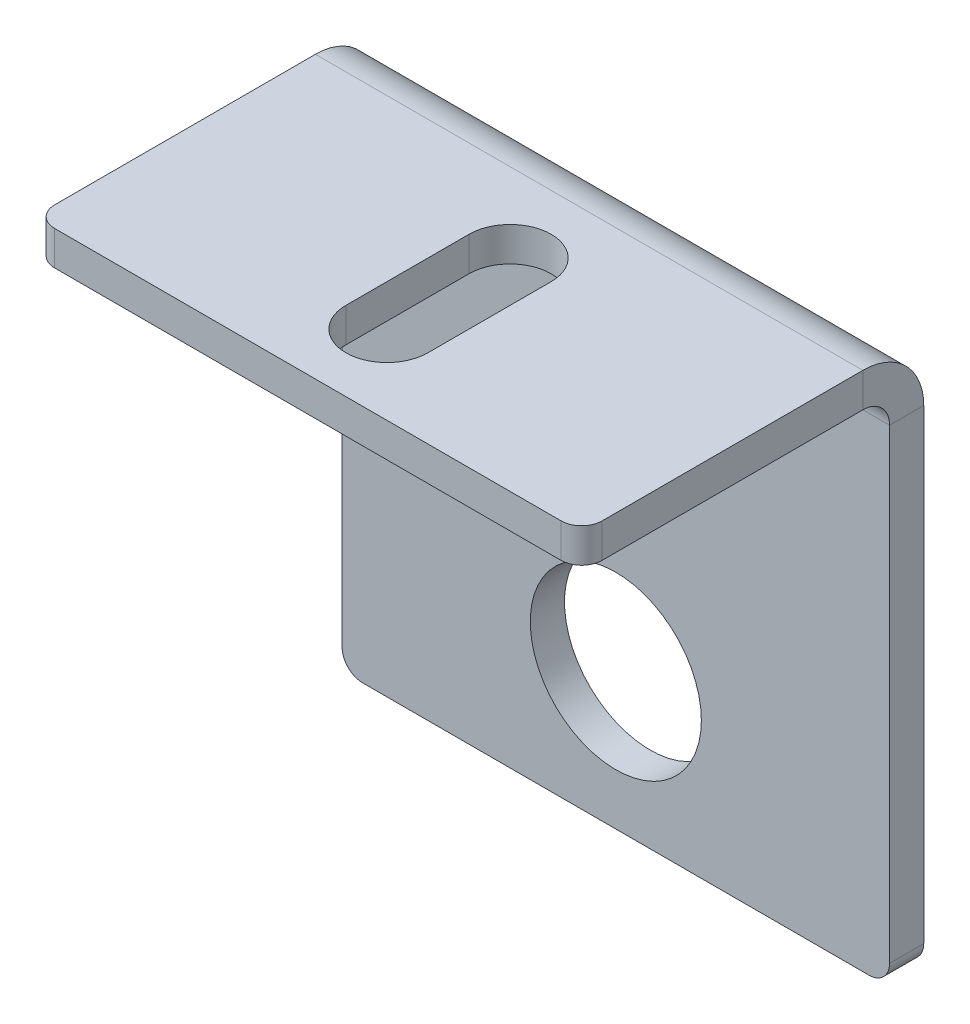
ISO-10303-21;
HEADER;
FILE_DESCRIPTION(('STEP AP214'),'2;1');
FILE_NAME('part.step','',(''),(''),'','','');
FILE_SCHEMA(('AUTOMOTIVE_DESIGN { 1 0 10303 214 1 1 1 1 }'));
ENDSEC;
DATA;
#1=APPLICATION_CONTEXT('core data for automotive mechanical design processes');
#2=APPLICATION_PROTOCOL_DEFINITION('international standard','automotive_design',2000,#1);
#3=PRODUCT_CONTEXT('',#1,'mechanical');
#4=PRODUCT('Part','Part','',(#3));
#5=PRODUCT_RELATED_PRODUCT_CATEGORY('part','',(#4));
#6=PRODUCT_DEFINITION_FORMATION('','',#4);
#7=PRODUCT_DEFINITION_CONTEXT('part definition',#1,'design');
#8=PRODUCT_DEFINITION('design','',#6,#7);
#9=PRODUCT_DEFINITION_SHAPE('','',#8);
#10=(LENGTH_UNIT() NAMED_UNIT(*) SI_UNIT(.MILLI.,.METRE.));
#11=(NAMED_UNIT(*) PLANE_ANGLE_UNIT() SI_UNIT($,.RADIAN.));
#12=(NAMED_UNIT(*) SI_UNIT($,.STERADIAN.) SOLID_ANGLE_UNIT());
#13=UNCERTAINTY_MEASURE_WITH_UNIT(LENGTH_MEASURE(1.E-05),#10,'distance_accuracy_value','');
#14=(GEOMETRIC_REPRESENTATION_CONTEXT(3) GLOBAL_UNCERTAINTY_ASSIGNED_CONTEXT((#13)) GLOBAL_UNIT_ASSIGNED_CONTEXT((#10,
#11,#12)) REPRESENTATION_CONTEXT('',''));
#15=CARTESIAN_POINT('',(0.,0.,0.));
#16=DIRECTION('',(0.,0.,1.));
#17=DIRECTION('',(1.,0.,0.));
#18=AXIS2_PLACEMENT_3D('',#15,#16,#17);
#19=CARTESIAN_POINT('',(-40.,-40.,-5.));
#20=DIRECTION('',(-1.,0.,0.));
#21=DIRECTION('',(0.,0.,1.));
#22=AXIS2_PLACEMENT_3D('',#19,#20,#21);
#23=PLANE('',#22);
#24=DIRECTION('',(0.,-1.,0.));
#25=VECTOR('',#24,1.);
#26=CARTESIAN_POINT('',(-40.,-40.,-5.));
#27=LINE('',#26,#25);
#28=CARTESIAN_POINT('',(-40.,31.1,-5.));
#29=VERTEX_POINT('',#28);
#30=CARTESIAN_POINT('',(-40.,-37.,-5.));
#31=VERTEX_POINT('',#30);
#32=EDGE_CURVE('E262',#29,#31,#27,.T.);
#33=ORIENTED_EDGE('',*,*,#32,.T.);
#34=DIRECTION('',(0.,0.,1.));
#35=VECTOR('',#34,1.);
#36=CARTESIAN_POINT('',(-40.,-37.,-5.));
#37=LINE('',#36,#35);
#38=CARTESIAN_POINT('',(-40.,-37.,0.));
#39=VERTEX_POINT('',#38);
#40=EDGE_CURVE('E271',#31,#39,#37,.T.);
#41=ORIENTED_EDGE('',*,*,#40,.T.);
#42=DIRECTION('',(0.,-1.,0.));
#43=VECTOR('',#42,1.);
#44=CARTESIAN_POINT('',(-40.,-40.,0.));
#45=LINE('',#44,#43);
#46=CARTESIAN_POINT('',(-40.,31.1,0.));
#47=VERTEX_POINT('',#46);
#48=EDGE_CURVE('E259',#47,#39,#45,.T.);
#49=ORIENTED_EDGE('',*,*,#48,.F.);
#50=DIRECTION('',(0.,0.,-1.));
#51=VECTOR('',#50,1.);
#52=CARTESIAN_POINT('',(-40.,31.1,0.));
#53=LINE('',#52,#51);
#54=EDGE_CURVE('E245',#47,#29,#53,.T.);
#55=ORIENTED_EDGE('',*,*,#54,.T.);
#56=EDGE_LOOP('',(#33,#41,#49,#55));
#57=FACE_BOUND('',#56,.T.);
#58=ADVANCED_FACE('F55',(#57),#23,.T.);
#59=CARTESIAN_POINT('',(0.,0.,-5.));
#60=DIRECTION('',(0.,0.,1.));
#61=DIRECTION('',(1.,0.,0.));
#62=AXIS2_PLACEMENT_3D('',#59,#60,#61);
#63=PLANE('',#62);
#64=CARTESIAN_POINT('',(0.,-19.9999999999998,-5.));
#65=DIRECTION('',(0.,0.,1.));
#66=DIRECTION('',(1.,0.,0.));
#67=AXIS2_PLACEMENT_3D('',#64,#65,#66);
#68=CIRCLE('',#67,12.5);
#69=CARTESIAN_POINT('',(12.5,-19.9999999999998,-5.));
#70=VERTEX_POINT('',#69);
#71=EDGE_CURVE('E207',#70,#70,#68,.F.);
#72=ORIENTED_EDGE('',*,*,#71,.F.);
#73=EDGE_LOOP('',(#72));
#74=FACE_BOUND('',#73,.T.);
#75=DIRECTION('',(1.,0.,0.));
#76=VECTOR('',#75,1.);
#77=CARTESIAN_POINT('',(40.,-40.,-5.));
#78=LINE('',#77,#76);
#79=CARTESIAN_POINT('',(-37.,-40.,-5.));
#80=VERTEX_POINT('',#79);
#81=CARTESIAN_POINT('',(37.,-40.,-5.));
#82=VERTEX_POINT('',#81);
#83=EDGE_CURVE('E265',#80,#82,#78,.T.);
#84=ORIENTED_EDGE('',*,*,#83,.F.);
#85=CARTESIAN_POINT('',(-37.,-37.,-5.));
#86=DIRECTION('',(0.,0.,1.));
#87=DIRECTION('',(1.,0.,0.));
#88=AXIS2_PLACEMENT_3D('',#85,#86,#87);
#89=CIRCLE('',#88,3.);
#90=EDGE_CURVE('E291',#80,#31,#89,.F.);
#91=ORIENTED_EDGE('',*,*,#90,.T.);
#92=ORIENTED_EDGE('',*,*,#32,.F.);
#93=DIRECTION('',(-1.,0.,0.));
#94=VECTOR('',#93,1.);
#95=CARTESIAN_POINT('',(-40.,31.1,-5.));
#96=LINE('',#95,#94);
#97=CARTESIAN_POINT('',(40.,31.1000000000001,-5.));
#98=VERTEX_POINT('',#97);
#99=EDGE_CURVE('E238',#29,#98,#96,.F.);
#100=ORIENTED_EDGE('',*,*,#99,.T.);
#101=DIRECTION('',(0.,1.,0.));
#102=VECTOR('',#101,1.);
#103=CARTESIAN_POINT('',(40.,-40.,-5.));
#104=LINE('',#103,#102);
#105=CARTESIAN_POINT('',(40.,-37.,-5.));
#106=VERTEX_POINT('',#105);
#107=EDGE_CURVE('E269',#106,#98,#104,.T.);
#108=ORIENTED_EDGE('',*,*,#107,.F.);
#109=CARTESIAN_POINT('',(37.,-37.,-5.));
#110=DIRECTION('',(0.,0.,1.));
#111=DIRECTION('',(1.,0.,0.));
#112=AXIS2_PLACEMENT_3D('',#109,#110,#111);
#113=CIRCLE('',#112,3.);
#114=EDGE_CURVE('E289',#106,#82,#113,.F.);
#115=ORIENTED_EDGE('',*,*,#114,.T.);
#116=EDGE_LOOP('',(#84,#91,#92,#100,#108,#115));
#117=FACE_BOUND('',#116,.T.);
#118=ADVANCED_FACE('F370',(#74,#117),#63,.F.);
#119=CARTESIAN_POINT('',(0.,0.,0.));
#120=DIRECTION('',(0.,0.,1.));
#121=DIRECTION('',(1.,0.,0.));
#122=AXIS2_PLACEMENT_3D('',#119,#120,#121);
#123=PLANE('',#122);
#124=CARTESIAN_POINT('',(0.,-19.9999999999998,0.));
#125=DIRECTION('',(0.,0.,1.));
#126=DIRECTION('',(1.,0.,0.));
#127=AXIS2_PLACEMENT_3D('',#124,#125,#126);
#128=CIRCLE('',#127,12.5);
#129=CARTESIAN_POINT('',(12.5,-19.9999999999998,0.));
#130=VERTEX_POINT('',#129);
#131=EDGE_CURVE('E201',#130,#130,#128,.T.);
#132=ORIENTED_EDGE('',*,*,#131,.F.);
#133=EDGE_LOOP('',(#132));
#134=FACE_BOUND('',#133,.T.);
#135=ORIENTED_EDGE('',*,*,#48,.T.);
#136=CARTESIAN_POINT('',(-37.,-37.,0.));
#137=DIRECTION('',(0.,0.,1.));
#138=DIRECTION('',(1.,0.,0.));
#139=AXIS2_PLACEMENT_3D('',#136,#137,#138);
#140=CIRCLE('',#139,3.);
#141=CARTESIAN_POINT('',(-37.,-40.,0.));
#142=VERTEX_POINT('',#141);
#143=EDGE_CURVE('E282',#39,#142,#140,.T.);
#144=ORIENTED_EDGE('',*,*,#143,.T.);
#145=DIRECTION('',(1.,0.,0.));
#146=VECTOR('',#145,1.);
#147=CARTESIAN_POINT('',(40.,-40.,0.));
#148=LINE('',#147,#146);
#149=CARTESIAN_POINT('',(37.,-40.,0.));
#150=VERTEX_POINT('',#149);
#151=EDGE_CURVE('E274',#142,#150,#148,.T.);
#152=ORIENTED_EDGE('',*,*,#151,.T.);
#153=CARTESIAN_POINT('',(37.,-37.,0.));
#154=DIRECTION('',(0.,0.,1.));
#155=DIRECTION('',(1.,0.,0.));
#156=AXIS2_PLACEMENT_3D('',#153,#154,#155);
#157=CIRCLE('',#156,3.);
#158=CARTESIAN_POINT('',(40.,-37.,0.));
#159=VERTEX_POINT('',#158);
#160=EDGE_CURVE('E280',#150,#159,#157,.T.);
#161=ORIENTED_EDGE('',*,*,#160,.T.);
#162=DIRECTION('',(0.,1.,0.));
#163=VECTOR('',#162,1.);
#164=CARTESIAN_POINT('',(40.,-40.,0.));
#165=LINE('',#164,#163);
#166=CARTESIAN_POINT('',(40.,31.1,0.));
#167=VERTEX_POINT('',#166);
#168=EDGE_CURVE('E266',#159,#167,#165,.T.);
#169=ORIENTED_EDGE('',*,*,#168,.T.);
#170=DIRECTION('',(-1.,0.,0.));
#171=VECTOR('',#170,1.);
#172=CARTESIAN_POINT('',(-40.,31.1,0.));
#173=LINE('',#172,#171);
#174=EDGE_CURVE('E251',#47,#167,#173,.F.);
#175=ORIENTED_EDGE('',*,*,#174,.F.);
#176=EDGE_LOOP('',(#135,#144,#152,#161,#169,#175));
#177=FACE_BOUND('',#176,.T.);
#178=ADVANCED_FACE('F349',(#134,#177),#123,.T.);
#179=CARTESIAN_POINT('',(40.,-40.,-5.));
#180=DIRECTION('',(1.,0.,0.));
#181=DIRECTION('',(0.,1.,0.));
#182=AXIS2_PLACEMENT_3D('',#179,#180,#181);
#183=PLANE('',#182);
#184=ORIENTED_EDGE('',*,*,#168,.F.);
#185=DIRECTION('',(0.,0.,1.));
#186=VECTOR('',#185,1.);
#187=CARTESIAN_POINT('',(40.,-37.,-5.));
#188=LINE('',#187,#186);
#189=EDGE_CURVE('E293',#159,#106,#188,.F.);
#190=ORIENTED_EDGE('',*,*,#189,.T.);
#191=ORIENTED_EDGE('',*,*,#107,.T.);
#192=DIRECTION('',(0.,0.,-1.));
#193=VECTOR('',#192,1.);
#194=CARTESIAN_POINT('',(40.,31.1,0.));
#195=LINE('',#194,#193);
#196=EDGE_CURVE('E256',#167,#98,#195,.T.);
#197=ORIENTED_EDGE('',*,*,#196,.F.);
#198=EDGE_LOOP('',(#184,#190,#191,#197));
#199=FACE_BOUND('',#198,.T.);
#200=ADVANCED_FACE('F367',(#199),#183,.T.);
#201=CARTESIAN_POINT('',(40.,-40.,-5.));
#202=DIRECTION('',(0.,-1.,0.));
#203=DIRECTION('',(1.,0.,0.));
#204=AXIS2_PLACEMENT_3D('',#201,#202,#203);
#205=PLANE('',#204);
#206=ORIENTED_EDGE('',*,*,#151,.F.);
#207=DIRECTION('',(0.,0.,1.));
#208=VECTOR('',#207,1.);
#209=CARTESIAN_POINT('',(-37.,-40.,-5.));
#210=LINE('',#209,#208);
#211=EDGE_CURVE('E287',#142,#80,#210,.F.);
#212=ORIENTED_EDGE('',*,*,#211,.T.);
#213=ORIENTED_EDGE('',*,*,#83,.T.);
#214=DIRECTION('',(0.,0.,1.));
#215=VECTOR('',#214,1.);
#216=CARTESIAN_POINT('',(37.,-40.,-5.));
#217=LINE('',#216,#215);
#218=EDGE_CURVE('E284',#82,#150,#217,.T.);
#219=ORIENTED_EDGE('',*,*,#218,.T.);
#220=EDGE_LOOP('',(#206,#212,#213,#219));
#221=FACE_BOUND('',#220,.T.);
#222=ADVANCED_FACE('F359',(#221),#205,.T.);
#223=CARTESIAN_POINT('',(40.,31.1,3.9));
#224=DIRECTION('',(1.,0.,0.));
#225=DIRECTION('',(0.,0.,-1.));
#226=AXIS2_PLACEMENT_3D('',#223,#224,#225);
#227=PLANE('',#226);
#228=DIRECTION('',(0.,-1.,0.));
#229=VECTOR('',#228,1.);
#230=CARTESIAN_POINT('',(40.,40.,3.89999999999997));
#231=LINE('',#230,#229);
#232=CARTESIAN_POINT('',(40.,35.,3.89999999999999));
#233=VERTEX_POINT('',#232);
#234=CARTESIAN_POINT('',(40.,40.,3.89999999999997));
#235=VERTEX_POINT('',#234);
#236=EDGE_CURVE('E210',#233,#235,#231,.F.);
#237=ORIENTED_EDGE('',*,*,#236,.F.);
#238=CARTESIAN_POINT('',(40.,31.1,3.9));
#239=DIRECTION('',(-1.,0.,0.));
#240=DIRECTION('',(0.,0.,1.));
#241=AXIS2_PLACEMENT_3D('',#238,#239,#240);
#242=CIRCLE('',#241,3.9);
#243=EDGE_CURVE('E248',#167,#233,#242,.F.);
#244=ORIENTED_EDGE('',*,*,#243,.F.);
#245=ORIENTED_EDGE('',*,*,#196,.T.);
#246=CARTESIAN_POINT('',(40.,31.1,3.9));
#247=DIRECTION('',(-1.,0.,0.));
#248=DIRECTION('',(0.,0.,1.));
#249=AXIS2_PLACEMENT_3D('',#246,#247,#248);
#250=CIRCLE('',#249,8.9);
#251=EDGE_CURVE('E241',#98,#235,#250,.F.);
#252=ORIENTED_EDGE('',*,*,#251,.T.);
#253=EDGE_LOOP('',(#237,#244,#245,#252));
#254=FACE_BOUND('',#253,.T.);
#255=ADVANCED_FACE('F338',(#254),#227,.T.);
#256=CARTESIAN_POINT('',(-40.,31.1,3.9));
#257=DIRECTION('',(1.,0.,0.));
#258=DIRECTION('',(0.,0.,-1.));
#259=AXIS2_PLACEMENT_3D('',#256,#257,#258);
#260=PLANE('',#259);
#261=CARTESIAN_POINT('',(-40.,31.1,3.9));
#262=DIRECTION('',(-1.,0.,0.));
#263=DIRECTION('',(0.,0.,1.));
#264=AXIS2_PLACEMENT_3D('',#261,#262,#263);
#265=CIRCLE('',#264,3.9);
#266=CARTESIAN_POINT('',(-40.,35.,3.89999999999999));
#267=VERTEX_POINT('',#266);
#268=EDGE_CURVE('E214',#267,#47,#265,.T.);
#269=ORIENTED_EDGE('',*,*,#268,.F.);
#270=DIRECTION('',(0.,-1.,0.));
#271=VECTOR('',#270,1.);
#272=CARTESIAN_POINT('',(-40.,35.,3.89999999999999));
#273=LINE('',#272,#271);
#274=CARTESIAN_POINT('',(-40.,40.,3.89999999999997));
#275=VERTEX_POINT('',#274);
#276=EDGE_CURVE('E231',#267,#275,#273,.F.);
#277=ORIENTED_EDGE('',*,*,#276,.T.);
#278=CARTESIAN_POINT('',(-40.,31.1,3.9));
#279=DIRECTION('',(-1.,0.,0.));
#280=DIRECTION('',(0.,0.,1.));
#281=AXIS2_PLACEMENT_3D('',#278,#279,#280);
#282=CIRCLE('',#281,8.9);
#283=EDGE_CURVE('E242',#275,#29,#282,.T.);
#284=ORIENTED_EDGE('',*,*,#283,.T.);
#285=ORIENTED_EDGE('',*,*,#54,.F.);
#286=EDGE_LOOP('',(#269,#277,#284,#285));
#287=FACE_BOUND('',#286,.T.);
#288=ADVANCED_FACE('F329',(#287),#260,.F.);
#289=CARTESIAN_POINT('',(-40.,31.1,3.9));
#290=DIRECTION('',(-1.,0.,0.));
#291=DIRECTION('',(0.,1.,0.));
#292=AXIS2_PLACEMENT_3D('',#289,#290,#291);
#293=CYLINDRICAL_SURFACE('',#292,8.9);
#294=ORIENTED_EDGE('',*,*,#99,.F.);
#295=ORIENTED_EDGE('',*,*,#283,.F.);
#296=DIRECTION('',(-1.,0.,0.));
#297=VECTOR('',#296,1.);
#298=CARTESIAN_POINT('',(40.,40.,3.89999999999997));
#299=LINE('',#298,#297);
#300=EDGE_CURVE('E228',#275,#235,#299,.F.);
#301=ORIENTED_EDGE('',*,*,#300,.T.);
#302=ORIENTED_EDGE('',*,*,#251,.F.);
#303=EDGE_LOOP('',(#294,#295,#301,#302));
#304=FACE_BOUND('',#303,.T.);
#305=ADVANCED_FACE('F335',(#304),#293,.T.);
#306=CARTESIAN_POINT('',(-40.,31.1,3.9));
#307=DIRECTION('',(-1.,0.,0.));
#308=DIRECTION('',(0.,1.,0.));
#309=AXIS2_PLACEMENT_3D('',#306,#307,#308);
#310=CYLINDRICAL_SURFACE('',#309,3.9);
#311=ORIENTED_EDGE('',*,*,#174,.T.);
#312=ORIENTED_EDGE('',*,*,#243,.T.);
#313=DIRECTION('',(-1.,0.,0.));
#314=VECTOR('',#313,1.);
#315=CARTESIAN_POINT('',(40.,35.,3.89999999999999));
#316=LINE('',#315,#314);
#317=EDGE_CURVE('E234',#233,#267,#316,.T.);
#318=ORIENTED_EDGE('',*,*,#317,.T.);
#319=ORIENTED_EDGE('',*,*,#268,.T.);
#320=EDGE_LOOP('',(#311,#312,#318,#319));
#321=FACE_BOUND('',#320,.T.);
#322=ADVANCED_FACE('F346',(#321),#310,.F.);
#323=CARTESIAN_POINT('',(40.,40.,0.));
#324=DIRECTION('',(-1.,0.,0.));
#325=DIRECTION('',(0.,0.,1.));
#326=AXIS2_PLACEMENT_3D('',#323,#324,#325);
#327=PLANE('',#326);
#328=DIRECTION('',(0.,0.,-1.));
#329=VECTOR('',#328,1.);
#330=CARTESIAN_POINT('',(40.,40.,-1.59319237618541E-13));
#331=LINE('',#330,#329);
#332=CARTESIAN_POINT('',(40.,40.0000000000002,42.));
#333=VERTEX_POINT('',#332);
#334=EDGE_CURVE('E218',#333,#235,#331,.T.);
#335=ORIENTED_EDGE('',*,*,#334,.F.);
#336=DIRECTION('',(0.,-1.,0.));
#337=VECTOR('',#336,1.);
#338=CARTESIAN_POINT('',(40.,40.0000000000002,42.));
#339=LINE('',#338,#337);
#340=CARTESIAN_POINT('',(40.,35.0000000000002,42.));
#341=VERTEX_POINT('',#340);
#342=EDGE_CURVE('E13',#333,#341,#339,.T.);
#343=ORIENTED_EDGE('',*,*,#342,.T.);
#344=DIRECTION('',(0.,0.,1.));
#345=VECTOR('',#344,1.);
#346=CARTESIAN_POINT('',(40.,35.,0.));
#347=LINE('',#346,#345);
#348=EDGE_CURVE('E226',#341,#233,#347,.F.);
#349=ORIENTED_EDGE('',*,*,#348,.T.);
#350=ORIENTED_EDGE('',*,*,#236,.T.);
#351=EDGE_LOOP('',(#335,#343,#349,#350));
#352=FACE_BOUND('',#351,.T.);
#353=ADVANCED_FACE('F342',(#352),#327,.F.);
#354=CARTESIAN_POINT('',(-40.,40.0000000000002,45.));
#355=DIRECTION('',(1.,0.,0.));
#356=DIRECTION('',(0.,0.,-1.));
#357=AXIS2_PLACEMENT_3D('',#354,#355,#356);
#358=PLANE('',#357);
#359=DIRECTION('',(0.,0.,-1.));
#360=VECTOR('',#359,1.);
#361=CARTESIAN_POINT('',(-40.,35.0000000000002,45.));
#362=LINE('',#361,#360);
#363=CARTESIAN_POINT('',(-40.,35.0000000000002,42.));
#364=VERTEX_POINT('',#363);
#365=EDGE_CURVE('E223',#267,#364,#362,.F.);
#366=ORIENTED_EDGE('',*,*,#365,.T.);
#367=DIRECTION('',(0.,-1.,0.));
#368=VECTOR('',#367,1.);
#369=CARTESIAN_POINT('',(-40.,40.0000000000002,42.));
#370=LINE('',#369,#368);
#371=CARTESIAN_POINT('',(-40.,40.0000000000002,42.));
#372=VERTEX_POINT('',#371);
#373=EDGE_CURVE('E304',#364,#372,#370,.F.);
#374=ORIENTED_EDGE('',*,*,#373,.T.);
#375=DIRECTION('',(0.,0.,1.));
#376=VECTOR('',#375,1.);
#377=CARTESIAN_POINT('',(-40.,40.,-1.59319237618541E-13));
#378=LINE('',#377,#376);
#379=EDGE_CURVE('E215',#275,#372,#378,.T.);
#380=ORIENTED_EDGE('',*,*,#379,.F.);
#381=ORIENTED_EDGE('',*,*,#276,.F.);
#382=EDGE_LOOP('',(#366,#374,#380,#381));
#383=FACE_BOUND('',#382,.T.);
#384=ADVANCED_FACE('F326',(#383),#358,.F.);
#385=CARTESIAN_POINT('',(0.,40.,-1.59319237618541E-13));
#386=DIRECTION('',(0.,-1.,0.));
#387=DIRECTION('',(0.,0.,-1.));
#388=AXIS2_PLACEMENT_3D('',#385,#386,#387);
#389=PLANE('',#388);
#390=DIRECTION('',(0.,0.,-1.));
#391=VECTOR('',#390,1.);
#392=CARTESIAN_POINT('',(-6.,40.0000000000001,15.45));
#393=LINE('',#392,#391);
#394=CARTESIAN_POINT('',(-6.,40.0000000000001,33.45));
#395=VERTEX_POINT('',#394);
#396=CARTESIAN_POINT('',(-6.,40.0000000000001,15.45));
#397=VERTEX_POINT('',#396);
#398=EDGE_CURVE('E176',#395,#397,#393,.T.);
#399=ORIENTED_EDGE('',*,*,#398,.T.);
#400=CARTESIAN_POINT('',(0.,40.0000000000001,15.45));
#401=DIRECTION('',(0.,-1.,0.));
#402=DIRECTION('',(0.,0.,-1.));
#403=AXIS2_PLACEMENT_3D('',#400,#401,#402);
#404=CIRCLE('',#403,6.);
#405=CARTESIAN_POINT('',(6.,40.0000000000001,15.45));
#406=VERTEX_POINT('',#405);
#407=EDGE_CURVE('E170',#397,#406,#404,.T.);
#408=ORIENTED_EDGE('',*,*,#407,.T.);
#409=DIRECTION('',(0.,0.,1.));
#410=VECTOR('',#409,1.);
#411=CARTESIAN_POINT('',(6.,40.0000000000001,15.45));
#412=LINE('',#411,#410);
#413=CARTESIAN_POINT('',(6.,40.0000000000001,33.45));
#414=VERTEX_POINT('',#413);
#415=EDGE_CURVE('E179',#406,#414,#412,.T.);
#416=ORIENTED_EDGE('',*,*,#415,.T.);
#417=CARTESIAN_POINT('',(0.,40.0000000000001,33.45));
#418=DIRECTION('',(0.,-1.,0.));
#419=DIRECTION('',(0.,0.,-1.));
#420=AXIS2_PLACEMENT_3D('',#417,#418,#419);
#421=CIRCLE('',#420,6.);
#422=EDGE_CURVE('E70',#414,#395,#421,.T.);
#423=ORIENTED_EDGE('',*,*,#422,.T.);
#424=EDGE_LOOP('',(#399,#408,#416,#423));
#425=FACE_BOUND('',#424,.T.);
#426=ORIENTED_EDGE('',*,*,#379,.T.);
#427=CARTESIAN_POINT('',(-37.,40.0000000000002,42.));
#428=DIRECTION('',(0.,-1.,0.));
#429=DIRECTION('',(0.,0.,-1.));
#430=AXIS2_PLACEMENT_3D('',#427,#428,#429);
#431=CIRCLE('',#430,3.);
#432=CARTESIAN_POINT('',(-37.,40.0000000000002,45.));
#433=VERTEX_POINT('',#432);
#434=EDGE_CURVE('E63',#372,#433,#431,.F.);
#435=ORIENTED_EDGE('',*,*,#434,.T.);
#436=DIRECTION('',(1.,0.,0.));
#437=VECTOR('',#436,1.);
#438=CARTESIAN_POINT('',(0.,40.0000000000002,45.));
#439=LINE('',#438,#437);
#440=CARTESIAN_POINT('',(37.,40.0000000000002,45.));
#441=VERTEX_POINT('',#440);
#442=EDGE_CURVE('E211',#433,#441,#439,.T.);
#443=ORIENTED_EDGE('',*,*,#442,.T.);
#444=CARTESIAN_POINT('',(37.,40.0000000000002,42.));
#445=DIRECTION('',(0.,-1.,0.));
#446=DIRECTION('',(0.,0.,-1.));
#447=AXIS2_PLACEMENT_3D('',#444,#445,#446);
#448=CIRCLE('',#447,3.);
#449=EDGE_CURVE('E306',#441,#333,#448,.F.);
#450=ORIENTED_EDGE('',*,*,#449,.T.);
#451=ORIENTED_EDGE('',*,*,#334,.T.);
#452=ORIENTED_EDGE('',*,*,#300,.F.);
#453=EDGE_LOOP('',(#426,#435,#443,#450,#451,#452));
#454=FACE_BOUND('',#453,.T.);
#455=ADVANCED_FACE('F183',(#425,#454),#389,.F.);
#456=CARTESIAN_POINT('',(0.,35.,-1.41861830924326E-13));
#457=DIRECTION('',(0.,-1.,0.));
#458=DIRECTION('',(0.,0.,-1.));
#459=AXIS2_PLACEMENT_3D('',#456,#457,#458);
#460=PLANE('',#459);
#461=CARTESIAN_POINT('',(0.,35.0000000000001,15.45));
#462=DIRECTION('',(0.,-1.,0.));
#463=DIRECTION('',(0.,0.,-1.));
#464=AXIS2_PLACEMENT_3D('',#461,#462,#463);
#465=CIRCLE('',#464,6.);
#466=CARTESIAN_POINT('',(-6.,35.0000000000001,15.45));
#467=VERTEX_POINT('',#466);
#468=CARTESIAN_POINT('',(6.,35.0000000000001,15.45));
#469=VERTEX_POINT('',#468);
#470=EDGE_CURVE('E78',#467,#469,#465,.T.);
#471=ORIENTED_EDGE('',*,*,#470,.F.);
#472=DIRECTION('',(0.,0.,-1.));
#473=VECTOR('',#472,1.);
#474=CARTESIAN_POINT('',(-6.,35.0000000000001,15.45));
#475=LINE('',#474,#473);
#476=CARTESIAN_POINT('',(-6.,35.0000000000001,33.45));
#477=VERTEX_POINT('',#476);
#478=EDGE_CURVE('E186',#477,#467,#475,.T.);
#479=ORIENTED_EDGE('',*,*,#478,.F.);
#480=CARTESIAN_POINT('',(0.,35.0000000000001,33.45));
#481=DIRECTION('',(0.,-1.,0.));
#482=DIRECTION('',(0.,0.,-1.));
#483=AXIS2_PLACEMENT_3D('',#480,#481,#482);
#484=CIRCLE('',#483,6.);
#485=CARTESIAN_POINT('',(6.,35.0000000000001,33.45));
#486=VERTEX_POINT('',#485);
#487=EDGE_CURVE('E189',#486,#477,#484,.T.);
#488=ORIENTED_EDGE('',*,*,#487,.F.);
#489=DIRECTION('',(0.,0.,1.));
#490=VECTOR('',#489,1.);
#491=CARTESIAN_POINT('',(6.,35.0000000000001,15.45));
#492=LINE('',#491,#490);
#493=EDGE_CURVE('E195',#469,#486,#492,.T.);
#494=ORIENTED_EDGE('',*,*,#493,.F.);
#495=EDGE_LOOP('',(#471,#479,#488,#494));
#496=FACE_BOUND('',#495,.T.);
#497=DIRECTION('',(-1.,0.,0.));
#498=VECTOR('',#497,1.);
#499=CARTESIAN_POINT('',(40.,35.0000000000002,45.));
#500=LINE('',#499,#498);
#501=CARTESIAN_POINT('',(-37.,35.0000000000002,45.));
#502=VERTEX_POINT('',#501);
#503=CARTESIAN_POINT('',(37.,35.0000000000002,45.));
#504=VERTEX_POINT('',#503);
#505=EDGE_CURVE('E220',#502,#504,#500,.F.);
#506=ORIENTED_EDGE('',*,*,#505,.F.);
#507=CARTESIAN_POINT('',(-37.,35.0000000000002,42.));
#508=DIRECTION('',(0.,-1.,0.));
#509=DIRECTION('',(0.,0.,-1.));
#510=AXIS2_PLACEMENT_3D('',#507,#508,#509);
#511=CIRCLE('',#510,3.);
#512=EDGE_CURVE('E302',#502,#364,#511,.T.);
#513=ORIENTED_EDGE('',*,*,#512,.T.);
#514=ORIENTED_EDGE('',*,*,#365,.F.);
#515=ORIENTED_EDGE('',*,*,#317,.F.);
#516=ORIENTED_EDGE('',*,*,#348,.F.);
#517=CARTESIAN_POINT('',(37.,35.0000000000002,42.));
#518=DIRECTION('',(0.,-1.,0.));
#519=DIRECTION('',(0.,0.,-1.));
#520=AXIS2_PLACEMENT_3D('',#517,#518,#519);
#521=CIRCLE('',#520,3.);
#522=EDGE_CURVE('E300',#341,#504,#521,.T.);
#523=ORIENTED_EDGE('',*,*,#522,.T.);
#524=EDGE_LOOP('',(#506,#513,#514,#515,#516,#523));
#525=FACE_BOUND('',#524,.T.);
#526=ADVANCED_FACE('F322',(#496,#525),#460,.T.);
#527=CARTESIAN_POINT('',(40.,40.0000000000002,45.));
#528=DIRECTION('',(0.,0.,-1.));
#529=DIRECTION('',(0.,1.,0.));
#530=AXIS2_PLACEMENT_3D('',#527,#528,#529);
#531=PLANE('',#530);
#532=ORIENTED_EDGE('',*,*,#442,.F.);
#533=DIRECTION('',(0.,-1.,0.));
#534=VECTOR('',#533,1.);
#535=CARTESIAN_POINT('',(-37.,40.0000000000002,45.));
#536=LINE('',#535,#534);
#537=EDGE_CURVE('E297',#433,#502,#536,.T.);
#538=ORIENTED_EDGE('',*,*,#537,.T.);
#539=ORIENTED_EDGE('',*,*,#505,.T.);
#540=DIRECTION('',(0.,-1.,0.));
#541=VECTOR('',#540,1.);
#542=CARTESIAN_POINT('',(37.,40.0000000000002,45.));
#543=LINE('',#542,#541);
#544=EDGE_CURVE('E295',#504,#441,#543,.F.);
#545=ORIENTED_EDGE('',*,*,#544,.T.);
#546=EDGE_LOOP('',(#532,#538,#539,#545));
#547=FACE_BOUND('',#546,.T.);
#548=ADVANCED_FACE('F316',(#547),#531,.F.);
#549=CARTESIAN_POINT('',(-37.,-37.,-5.));
#550=DIRECTION('',(0.,0.,1.));
#551=DIRECTION('',(1.,0.,0.));
#552=AXIS2_PLACEMENT_3D('',#549,#550,#551);
#553=CYLINDRICAL_SURFACE('',#552,3.);
#554=ORIENTED_EDGE('',*,*,#90,.F.);
#555=ORIENTED_EDGE('',*,*,#211,.F.);
#556=ORIENTED_EDGE('',*,*,#143,.F.);
#557=ORIENTED_EDGE('',*,*,#40,.F.);
#558=EDGE_LOOP('',(#554,#555,#556,#557));
#559=FACE_BOUND('',#558,.T.);
#560=ADVANCED_FACE('F355',(#559),#553,.T.);
#561=CARTESIAN_POINT('',(37.,-37.,-5.));
#562=DIRECTION('',(0.,0.,1.));
#563=DIRECTION('',(1.,0.,0.));
#564=AXIS2_PLACEMENT_3D('',#561,#562,#563);
#565=CYLINDRICAL_SURFACE('',#564,3.);
#566=ORIENTED_EDGE('',*,*,#114,.F.);
#567=ORIENTED_EDGE('',*,*,#189,.F.);
#568=ORIENTED_EDGE('',*,*,#160,.F.);
#569=ORIENTED_EDGE('',*,*,#218,.F.);
#570=EDGE_LOOP('',(#566,#567,#568,#569));
#571=FACE_BOUND('',#570,.T.);
#572=ADVANCED_FACE('F364',(#571),#565,.T.);
#573=CARTESIAN_POINT('',(-37.,40.0000000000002,42.));
#574=DIRECTION('',(0.,-1.,0.));
#575=DIRECTION('',(0.,0.,-1.));
#576=AXIS2_PLACEMENT_3D('',#573,#574,#575);
#577=CYLINDRICAL_SURFACE('',#576,3.);
#578=ORIENTED_EDGE('',*,*,#434,.F.);
#579=ORIENTED_EDGE('',*,*,#373,.F.);
#580=ORIENTED_EDGE('',*,*,#512,.F.);
#581=ORIENTED_EDGE('',*,*,#537,.F.);
#582=EDGE_LOOP('',(#578,#579,#580,#581));
#583=FACE_BOUND('',#582,.T.);
#584=ADVANCED_FACE('F319',(#583),#577,.T.);
#585=CARTESIAN_POINT('',(37.,40.0000000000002,42.));
#586=DIRECTION('',(0.,-1.,0.));
#587=DIRECTION('',(0.,0.,-1.));
#588=AXIS2_PLACEMENT_3D('',#585,#586,#587);
#589=CYLINDRICAL_SURFACE('',#588,3.);
#590=ORIENTED_EDGE('',*,*,#449,.F.);
#591=ORIENTED_EDGE('',*,*,#544,.F.);
#592=ORIENTED_EDGE('',*,*,#522,.F.);
#593=ORIENTED_EDGE('',*,*,#342,.F.);
#594=EDGE_LOOP('',(#590,#591,#592,#593));
#595=FACE_BOUND('',#594,.T.);
#596=ADVANCED_FACE('F57',(#595),#589,.T.);
#597=CARTESIAN_POINT('',(0.,-19.9999999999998,-40.3553390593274));
#598=DIRECTION('',(0.,0.,1.));
#599=DIRECTION('',(1.,0.,0.));
#600=AXIS2_PLACEMENT_3D('',#597,#598,#599);
#601=CYLINDRICAL_SURFACE('',#600,12.5);
#602=ORIENTED_EDGE('',*,*,#71,.T.);
#603=EDGE_LOOP('',(#602));
#604=FACE_BOUND('',#603,.T.);
#605=ORIENTED_EDGE('',*,*,#131,.T.);
#606=EDGE_LOOP('',(#605));
#607=FACE_BOUND('',#606,.T.);
#608=ADVANCED_FACE('F396',(#604,#607),#601,.F.);
#609=CARTESIAN_POINT('',(0.,40.0000000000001,15.45));
#610=DIRECTION('',(0.,-1.,0.));
#611=DIRECTION('',(0.,0.,-1.));
#612=AXIS2_PLACEMENT_3D('',#609,#610,#611);
#613=CYLINDRICAL_SURFACE('',#612,6.);
#614=ORIENTED_EDGE('',*,*,#470,.T.);
#615=DIRECTION('',(0.,-1.,0.));
#616=VECTOR('',#615,1.);
#617=CARTESIAN_POINT('',(6.,40.0000000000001,15.45));
#618=LINE('',#617,#616);
#619=EDGE_CURVE('E166',#406,#469,#618,.T.);
#620=ORIENTED_EDGE('',*,*,#619,.F.);
#621=ORIENTED_EDGE('',*,*,#407,.F.);
#622=DIRECTION('',(0.,-1.,0.));
#623=VECTOR('',#622,1.);
#624=CARTESIAN_POINT('',(-6.,40.0000000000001,15.45));
#625=LINE('',#624,#623);
#626=EDGE_CURVE('E199',#397,#467,#625,.T.);
#627=ORIENTED_EDGE('',*,*,#626,.T.);
#628=EDGE_LOOP('',(#614,#620,#621,#627));
#629=FACE_BOUND('',#628,.T.);
#630=ADVANCED_FACE('F168',(#629),#613,.F.);
#631=CARTESIAN_POINT('',(-6.,40.0000000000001,15.45));
#632=DIRECTION('',(-1.,0.,0.));
#633=DIRECTION('',(0.,0.,1.));
#634=AXIS2_PLACEMENT_3D('',#631,#632,#633);
#635=PLANE('',#634);
#636=ORIENTED_EDGE('',*,*,#478,.T.);
#637=ORIENTED_EDGE('',*,*,#626,.F.);
#638=ORIENTED_EDGE('',*,*,#398,.F.);
#639=DIRECTION('',(0.,-1.,0.));
#640=VECTOR('',#639,1.);
#641=CARTESIAN_POINT('',(-6.,40.0000000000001,33.45));
#642=LINE('',#641,#640);
#643=EDGE_CURVE('E202',#395,#477,#642,.T.);
#644=ORIENTED_EDGE('',*,*,#643,.T.);
#645=EDGE_LOOP('',(#636,#637,#638,#644));
#646=FACE_BOUND('',#645,.T.);
#647=ADVANCED_FACE('F406',(#646),#635,.F.);
#648=CARTESIAN_POINT('',(0.,40.0000000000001,33.45));
#649=DIRECTION('',(0.,-1.,0.));
#650=DIRECTION('',(0.,0.,-1.));
#651=AXIS2_PLACEMENT_3D('',#648,#649,#650);
#652=CYLINDRICAL_SURFACE('',#651,6.);
#653=ORIENTED_EDGE('',*,*,#487,.T.);
#654=ORIENTED_EDGE('',*,*,#643,.F.);
#655=ORIENTED_EDGE('',*,*,#422,.F.);
#656=DIRECTION('',(0.,-1.,0.));
#657=VECTOR('',#656,1.);
#658=CARTESIAN_POINT('',(6.,40.0000000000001,33.45));
#659=LINE('',#658,#657);
#660=EDGE_CURVE('E175',#414,#486,#659,.T.);
#661=ORIENTED_EDGE('',*,*,#660,.T.);
#662=EDGE_LOOP('',(#653,#654,#655,#661));
#663=FACE_BOUND('',#662,.T.);
#664=ADVANCED_FACE('F514',(#663),#652,.F.);
#665=CARTESIAN_POINT('',(6.,40.0000000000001,15.45));
#666=DIRECTION('',(1.,0.,0.));
#667=DIRECTION('',(0.,0.,-1.));
#668=AXIS2_PLACEMENT_3D('',#665,#666,#667);
#669=PLANE('',#668);
#670=ORIENTED_EDGE('',*,*,#493,.T.);
#671=ORIENTED_EDGE('',*,*,#660,.F.);
#672=ORIENTED_EDGE('',*,*,#415,.F.);
#673=ORIENTED_EDGE('',*,*,#619,.T.);
#674=EDGE_LOOP('',(#670,#671,#672,#673));
#675=FACE_BOUND('',#674,.T.);
#676=ADVANCED_FACE('F180',(#675),#669,.F.);
#677=CLOSED_SHELL('',(#58,#118,#178,#200,#222,#255,#288,#305,#322,#353,#384,#455,#526,#548,#560,
#572,#584,#596,#608,#630,#647,#664,#676));
#678=MANIFOLD_SOLID_BREP('B2',#677);
#679=ADVANCED_BREP_SHAPE_REPRESENTATION('',(#18,#678),#14);
#680=SHAPE_DEFINITION_REPRESENTATION(#9,#679);
ENDSEC;
END-ISO-10303-21;
